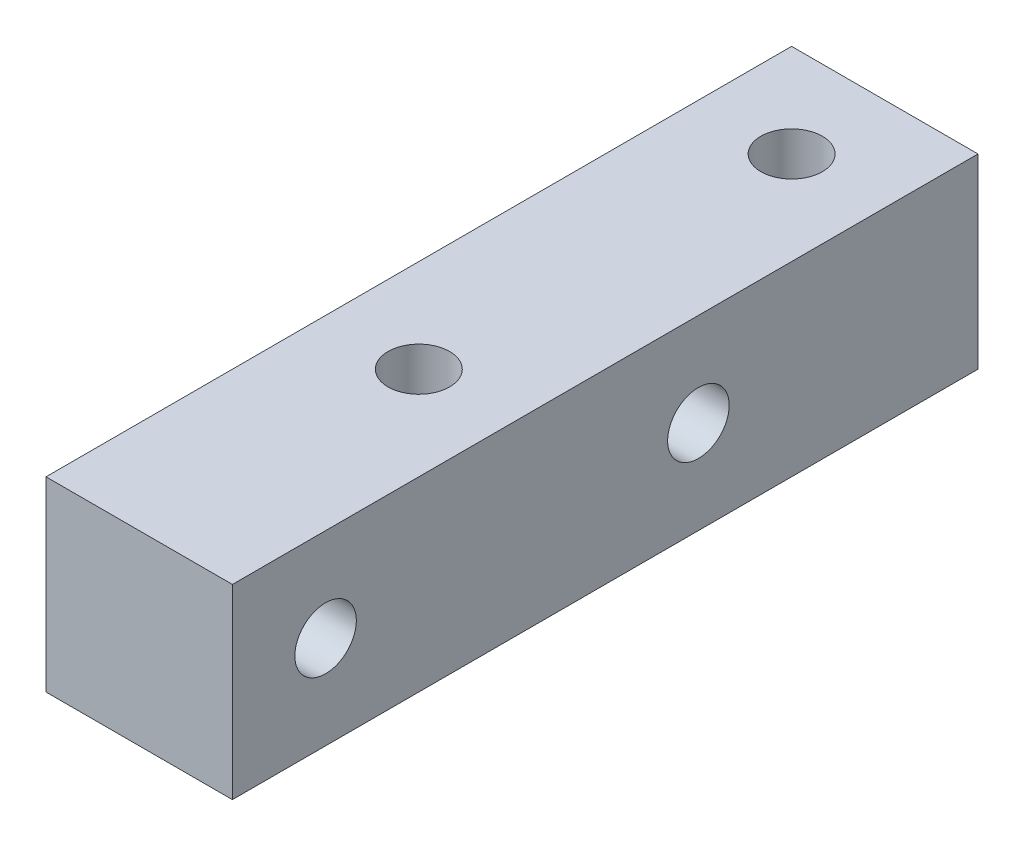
ISO-10303-21;
HEADER;
FILE_DESCRIPTION(('STEP AP214'),'2;1');
FILE_NAME('part.step','',(''),(''),'','','');
FILE_SCHEMA(('AUTOMOTIVE_DESIGN { 1 0 10303 214 1 1 1 1 }'));
ENDSEC;
DATA;
#1=APPLICATION_CONTEXT('core data for automotive mechanical design processes');
#2=APPLICATION_PROTOCOL_DEFINITION('international standard','automotive_design',2000,#1);
#3=PRODUCT_CONTEXT('',#1,'mechanical');
#4=PRODUCT('Part','Part','',(#3));
#5=PRODUCT_RELATED_PRODUCT_CATEGORY('part','',(#4));
#6=PRODUCT_DEFINITION_FORMATION('','',#4);
#7=PRODUCT_DEFINITION_CONTEXT('part definition',#1,'design');
#8=PRODUCT_DEFINITION('design','',#6,#7);
#9=PRODUCT_DEFINITION_SHAPE('','',#8);
#10=(LENGTH_UNIT() NAMED_UNIT(*) SI_UNIT(.MILLI.,.METRE.));
#11=(NAMED_UNIT(*) PLANE_ANGLE_UNIT() SI_UNIT($,.RADIAN.));
#12=(NAMED_UNIT(*) SI_UNIT($,.STERADIAN.) SOLID_ANGLE_UNIT());
#13=UNCERTAINTY_MEASURE_WITH_UNIT(LENGTH_MEASURE(1.E-05),#10,'distance_accuracy_value','');
#14=(GEOMETRIC_REPRESENTATION_CONTEXT(3) GLOBAL_UNCERTAINTY_ASSIGNED_CONTEXT((#13)) GLOBAL_UNIT_ASSIGNED_CONTEXT((#10,
#11,#12)) REPRESENTATION_CONTEXT('',''));
#15=CARTESIAN_POINT('',(0.,0.,0.));
#16=DIRECTION('',(0.,0.,1.));
#17=DIRECTION('',(1.,0.,0.));
#18=AXIS2_PLACEMENT_3D('',#15,#16,#17);
#19=CARTESIAN_POINT('',(5.,5.,40.));
#20=DIRECTION('',(-1.,0.,0.));
#21=DIRECTION('',(0.,0.,1.));
#22=AXIS2_PLACEMENT_3D('',#19,#20,#21);
#23=PLANE('',#22);
#24=CARTESIAN_POINT('',(5.,0.,35.));
#25=DIRECTION('',(1.,0.,0.));
#26=DIRECTION('',(0.,0.,-1.));
#27=AXIS2_PLACEMENT_3D('',#24,#25,#26);
#28=CIRCLE('',#27,1.64999999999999);
#29=CARTESIAN_POINT('',(5.,0.,33.35));
#30=VERTEX_POINT('',#29);
#31=EDGE_CURVE('E138',#30,#30,#28,.T.);
#32=ORIENTED_EDGE('',*,*,#31,.F.);
#33=EDGE_LOOP('',(#32));
#34=FACE_BOUND('',#33,.T.);
#35=CARTESIAN_POINT('',(5.,0.,15.));
#36=DIRECTION('',(1.,0.,0.));
#37=DIRECTION('',(0.,0.,-1.));
#38=AXIS2_PLACEMENT_3D('',#35,#36,#37);
#39=CIRCLE('',#38,1.64999999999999);
#40=CARTESIAN_POINT('',(5.,0.,13.35));
#41=VERTEX_POINT('',#40);
#42=EDGE_CURVE('E132',#41,#41,#39,.T.);
#43=ORIENTED_EDGE('',*,*,#42,.F.);
#44=EDGE_LOOP('',(#43));
#45=FACE_BOUND('',#44,.T.);
#46=DIRECTION('',(0.,1.,0.));
#47=VECTOR('',#46,1.);
#48=CARTESIAN_POINT('',(5.,5.,0.));
#49=LINE('',#48,#47);
#50=CARTESIAN_POINT('',(5.,-5.,0.));
#51=VERTEX_POINT('',#50);
#52=CARTESIAN_POINT('',(5.,5.,0.));
#53=VERTEX_POINT('',#52);
#54=EDGE_CURVE('E104',#51,#53,#49,.T.);
#55=ORIENTED_EDGE('',*,*,#54,.T.);
#56=DIRECTION('',(0.,0.,-1.));
#57=VECTOR('',#56,1.);
#58=CARTESIAN_POINT('',(5.,5.,40.));
#59=LINE('',#58,#57);
#60=CARTESIAN_POINT('',(5.,5.,40.));
#61=VERTEX_POINT('',#60);
#62=EDGE_CURVE('E11',#61,#53,#59,.T.);
#63=ORIENTED_EDGE('',*,*,#62,.F.);
#64=DIRECTION('',(0.,1.,0.));
#65=VECTOR('',#64,1.);
#66=CARTESIAN_POINT('',(5.,5.,40.));
#67=LINE('',#66,#65);
#68=CARTESIAN_POINT('',(5.,-5.,40.));
#69=VERTEX_POINT('',#68);
#70=EDGE_CURVE('E92',#69,#61,#67,.T.);
#71=ORIENTED_EDGE('',*,*,#70,.F.);
#72=DIRECTION('',(0.,0.,-1.));
#73=VECTOR('',#72,1.);
#74=CARTESIAN_POINT('',(5.,-5.,40.));
#75=LINE('',#74,#73);
#76=EDGE_CURVE('E100',#69,#51,#75,.T.);
#77=ORIENTED_EDGE('',*,*,#76,.T.);
#78=EDGE_LOOP('',(#55,#63,#71,#77));
#79=FACE_BOUND('',#78,.T.);
#80=ADVANCED_FACE('F41',(#34,#45,#79),#23,.F.);
#81=CARTESIAN_POINT('',(-5.,5.,40.));
#82=DIRECTION('',(0.,-1.,0.));
#83=DIRECTION('',(0.,0.,-1.));
#84=AXIS2_PLACEMENT_3D('',#81,#82,#83);
#85=PLANE('',#84);
#86=CARTESIAN_POINT('',(0.,5.,5.));
#87=DIRECTION('',(0.,1.,0.));
#88=DIRECTION('',(0.,0.,1.));
#89=AXIS2_PLACEMENT_3D('',#86,#87,#88);
#90=CIRCLE('',#89,1.65);
#91=CARTESIAN_POINT('',(0.,5.,6.65));
#92=VERTEX_POINT('',#91);
#93=EDGE_CURVE('E126',#92,#92,#90,.T.);
#94=ORIENTED_EDGE('',*,*,#93,.F.);
#95=EDGE_LOOP('',(#94));
#96=FACE_BOUND('',#95,.T.);
#97=CARTESIAN_POINT('',(0.,5.,25.));
#98=DIRECTION('',(0.,1.,0.));
#99=DIRECTION('',(0.,0.,1.));
#100=AXIS2_PLACEMENT_3D('',#97,#98,#99);
#101=CIRCLE('',#100,1.65);
#102=CARTESIAN_POINT('',(0.,5.,26.65));
#103=VERTEX_POINT('',#102);
#104=EDGE_CURVE('E120',#103,#103,#101,.T.);
#105=ORIENTED_EDGE('',*,*,#104,.F.);
#106=EDGE_LOOP('',(#105));
#107=FACE_BOUND('',#106,.T.);
#108=DIRECTION('',(-1.,0.,0.));
#109=VECTOR('',#108,1.);
#110=CARTESIAN_POINT('',(-5.,5.,0.));
#111=LINE('',#110,#109);
#112=CARTESIAN_POINT('',(-5.,5.,0.));
#113=VERTEX_POINT('',#112);
#114=EDGE_CURVE('E96',#53,#113,#111,.T.);
#115=ORIENTED_EDGE('',*,*,#114,.T.);
#116=DIRECTION('',(0.,0.,-1.));
#117=VECTOR('',#116,1.);
#118=CARTESIAN_POINT('',(-5.,5.,40.));
#119=LINE('',#118,#117);
#120=CARTESIAN_POINT('',(-5.,5.,40.));
#121=VERTEX_POINT('',#120);
#122=EDGE_CURVE('E49',#121,#113,#119,.T.);
#123=ORIENTED_EDGE('',*,*,#122,.F.);
#124=DIRECTION('',(-1.,0.,0.));
#125=VECTOR('',#124,1.);
#126=CARTESIAN_POINT('',(-5.,5.,40.));
#127=LINE('',#126,#125);
#128=EDGE_CURVE('E87',#61,#121,#127,.T.);
#129=ORIENTED_EDGE('',*,*,#128,.F.);
#130=ORIENTED_EDGE('',*,*,#62,.T.);
#131=EDGE_LOOP('',(#115,#123,#129,#130));
#132=FACE_BOUND('',#131,.T.);
#133=ADVANCED_FACE('F95',(#96,#107,#132),#85,.F.);
#134=CARTESIAN_POINT('',(-5.,5.,40.));
#135=DIRECTION('',(1.,0.,0.));
#136=DIRECTION('',(0.,1.,0.));
#137=AXIS2_PLACEMENT_3D('',#134,#135,#136);
#138=PLANE('',#137);
#139=CARTESIAN_POINT('',(-4.99999999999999,0.,35.));
#140=DIRECTION('',(1.,0.,0.));
#141=DIRECTION('',(0.,0.,-1.));
#142=AXIS2_PLACEMENT_3D('',#139,#140,#141);
#143=CIRCLE('',#142,1.64999999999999);
#144=CARTESIAN_POINT('',(-4.99999999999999,0.,33.35));
#145=VERTEX_POINT('',#144);
#146=EDGE_CURVE('E135',#145,#145,#143,.T.);
#147=ORIENTED_EDGE('',*,*,#146,.T.);
#148=EDGE_LOOP('',(#147));
#149=FACE_BOUND('',#148,.T.);
#150=CARTESIAN_POINT('',(-4.99999999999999,0.,15.));
#151=DIRECTION('',(1.,0.,0.));
#152=DIRECTION('',(0.,0.,-1.));
#153=AXIS2_PLACEMENT_3D('',#150,#151,#152);
#154=CIRCLE('',#153,1.64999999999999);
#155=CARTESIAN_POINT('',(-4.99999999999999,0.,13.35));
#156=VERTEX_POINT('',#155);
#157=EDGE_CURVE('E129',#156,#156,#154,.T.);
#158=ORIENTED_EDGE('',*,*,#157,.T.);
#159=EDGE_LOOP('',(#158));
#160=FACE_BOUND('',#159,.T.);
#161=DIRECTION('',(0.,-1.,0.));
#162=VECTOR('',#161,1.);
#163=CARTESIAN_POINT('',(-5.,5.,0.));
#164=LINE('',#163,#162);
#165=CARTESIAN_POINT('',(-5.,-5.,0.));
#166=VERTEX_POINT('',#165);
#167=EDGE_CURVE('E74',#113,#166,#164,.T.);
#168=ORIENTED_EDGE('',*,*,#167,.T.);
#169=DIRECTION('',(0.,0.,-1.));
#170=VECTOR('',#169,1.);
#171=CARTESIAN_POINT('',(-5.,-5.,40.));
#172=LINE('',#171,#170);
#173=CARTESIAN_POINT('',(-5.,-5.,40.));
#174=VERTEX_POINT('',#173);
#175=EDGE_CURVE('E97',#174,#166,#172,.T.);
#176=ORIENTED_EDGE('',*,*,#175,.F.);
#177=DIRECTION('',(0.,-1.,0.));
#178=VECTOR('',#177,1.);
#179=CARTESIAN_POINT('',(-5.,5.,40.));
#180=LINE('',#179,#178);
#181=EDGE_CURVE('E90',#121,#174,#180,.T.);
#182=ORIENTED_EDGE('',*,*,#181,.F.);
#183=ORIENTED_EDGE('',*,*,#122,.T.);
#184=EDGE_LOOP('',(#168,#176,#182,#183));
#185=FACE_BOUND('',#184,.T.);
#186=ADVANCED_FACE('F98',(#149,#160,#185),#138,.F.);
#187=CARTESIAN_POINT('',(-5.,-5.,40.));
#188=DIRECTION('',(0.,1.,0.));
#189=DIRECTION('',(0.,0.,1.));
#190=AXIS2_PLACEMENT_3D('',#187,#188,#189);
#191=PLANE('',#190);
#192=CARTESIAN_POINT('',(0.,-5.,5.));
#193=DIRECTION('',(0.,1.,0.));
#194=DIRECTION('',(0.,0.,1.));
#195=AXIS2_PLACEMENT_3D('',#192,#193,#194);
#196=CIRCLE('',#195,1.65);
#197=CARTESIAN_POINT('',(0.,-5.,6.65));
#198=VERTEX_POINT('',#197);
#199=EDGE_CURVE('E123',#198,#198,#196,.T.);
#200=ORIENTED_EDGE('',*,*,#199,.T.);
#201=EDGE_LOOP('',(#200));
#202=FACE_BOUND('',#201,.T.);
#203=CARTESIAN_POINT('',(0.,-5.,25.));
#204=DIRECTION('',(0.,1.,0.));
#205=DIRECTION('',(0.,0.,1.));
#206=AXIS2_PLACEMENT_3D('',#203,#204,#205);
#207=CIRCLE('',#206,1.65);
#208=CARTESIAN_POINT('',(0.,-5.,26.65));
#209=VERTEX_POINT('',#208);
#210=EDGE_CURVE('E107',#209,#209,#207,.T.);
#211=ORIENTED_EDGE('',*,*,#210,.T.);
#212=EDGE_LOOP('',(#211));
#213=FACE_BOUND('',#212,.T.);
#214=DIRECTION('',(1.,0.,0.));
#215=VECTOR('',#214,1.);
#216=CARTESIAN_POINT('',(-5.,-5.,0.));
#217=LINE('',#216,#215);
#218=EDGE_CURVE('E80',#166,#51,#217,.T.);
#219=ORIENTED_EDGE('',*,*,#218,.T.);
#220=ORIENTED_EDGE('',*,*,#76,.F.);
#221=DIRECTION('',(1.,0.,0.));
#222=VECTOR('',#221,1.);
#223=CARTESIAN_POINT('',(-5.,-5.,40.));
#224=LINE('',#223,#222);
#225=EDGE_CURVE('E57',#174,#69,#224,.T.);
#226=ORIENTED_EDGE('',*,*,#225,.F.);
#227=ORIENTED_EDGE('',*,*,#175,.T.);
#228=EDGE_LOOP('',(#219,#220,#226,#227));
#229=FACE_BOUND('',#228,.T.);
#230=ADVANCED_FACE('F112',(#202,#213,#229),#191,.F.);
#231=CARTESIAN_POINT('',(0.,0.,40.));
#232=DIRECTION('',(0.,0.,1.));
#233=DIRECTION('',(1.,0.,0.));
#234=AXIS2_PLACEMENT_3D('',#231,#232,#233);
#235=PLANE('',#234);
#236=ORIENTED_EDGE('',*,*,#70,.T.);
#237=ORIENTED_EDGE('',*,*,#128,.T.);
#238=ORIENTED_EDGE('',*,*,#181,.T.);
#239=ORIENTED_EDGE('',*,*,#225,.T.);
#240=EDGE_LOOP('',(#236,#237,#238,#239));
#241=FACE_BOUND('',#240,.T.);
#242=ADVANCED_FACE('F88',(#241),#235,.T.);
#243=CARTESIAN_POINT('',(0.,0.,0.));
#244=DIRECTION('',(0.,0.,1.));
#245=DIRECTION('',(1.,0.,0.));
#246=AXIS2_PLACEMENT_3D('',#243,#244,#245);
#247=PLANE('',#246);
#248=ORIENTED_EDGE('',*,*,#54,.F.);
#249=ORIENTED_EDGE('',*,*,#218,.F.);
#250=ORIENTED_EDGE('',*,*,#167,.F.);
#251=ORIENTED_EDGE('',*,*,#114,.F.);
#252=EDGE_LOOP('',(#248,#249,#250,#251));
#253=FACE_BOUND('',#252,.T.);
#254=ADVANCED_FACE('F115',(#253),#247,.F.);
#255=CARTESIAN_POINT('',(0.,5.,25.));
#256=DIRECTION('',(0.,1.,0.));
#257=DIRECTION('',(0.,0.,1.));
#258=AXIS2_PLACEMENT_3D('',#255,#256,#257);
#259=CYLINDRICAL_SURFACE('',#258,1.65);
#260=ORIENTED_EDGE('',*,*,#210,.F.);
#261=EDGE_LOOP('',(#260));
#262=FACE_BOUND('',#261,.T.);
#263=ORIENTED_EDGE('',*,*,#104,.T.);
#264=EDGE_LOOP('',(#263));
#265=FACE_BOUND('',#264,.T.);
#266=ADVANCED_FACE('F159',(#262,#265),#259,.F.);
#267=CARTESIAN_POINT('',(0.,5.,5.));
#268=DIRECTION('',(0.,1.,0.));
#269=DIRECTION('',(0.,0.,1.));
#270=AXIS2_PLACEMENT_3D('',#267,#268,#269);
#271=CYLINDRICAL_SURFACE('',#270,1.65);
#272=ORIENTED_EDGE('',*,*,#199,.F.);
#273=EDGE_LOOP('',(#272));
#274=FACE_BOUND('',#273,.T.);
#275=ORIENTED_EDGE('',*,*,#93,.T.);
#276=EDGE_LOOP('',(#275));
#277=FACE_BOUND('',#276,.T.);
#278=ADVANCED_FACE('F150',(#274,#277),#271,.F.);
#279=CARTESIAN_POINT('',(5.,0.,15.));
#280=DIRECTION('',(1.,0.,0.));
#281=DIRECTION('',(0.,0.,-1.));
#282=AXIS2_PLACEMENT_3D('',#279,#280,#281);
#283=CYLINDRICAL_SURFACE('',#282,1.64999999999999);
#284=ORIENTED_EDGE('',*,*,#157,.F.);
#285=EDGE_LOOP('',(#284));
#286=FACE_BOUND('',#285,.T.);
#287=ORIENTED_EDGE('',*,*,#42,.T.);
#288=EDGE_LOOP('',(#287));
#289=FACE_BOUND('',#288,.T.);
#290=ADVANCED_FACE('F148',(#286,#289),#283,.F.);
#291=CARTESIAN_POINT('',(5.,0.,35.));
#292=DIRECTION('',(1.,0.,0.));
#293=DIRECTION('',(0.,0.,-1.));
#294=AXIS2_PLACEMENT_3D('',#291,#292,#293);
#295=CYLINDRICAL_SURFACE('',#294,1.64999999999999);
#296=ORIENTED_EDGE('',*,*,#146,.F.);
#297=EDGE_LOOP('',(#296));
#298=FACE_BOUND('',#297,.T.);
#299=ORIENTED_EDGE('',*,*,#31,.T.);
#300=EDGE_LOOP('',(#299));
#301=FACE_BOUND('',#300,.T.);
#302=ADVANCED_FACE('F142',(#298,#301),#295,.F.);
#303=CLOSED_SHELL('',(#80,#133,#186,#230,#242,#254,#266,#278,#290,#302));
#304=MANIFOLD_SOLID_BREP('B2',#303);
#305=ADVANCED_BREP_SHAPE_REPRESENTATION('',(#18,#304),#14);
#306=SHAPE_DEFINITION_REPRESENTATION(#9,#305);
ENDSEC;
END-ISO-10303-21;
